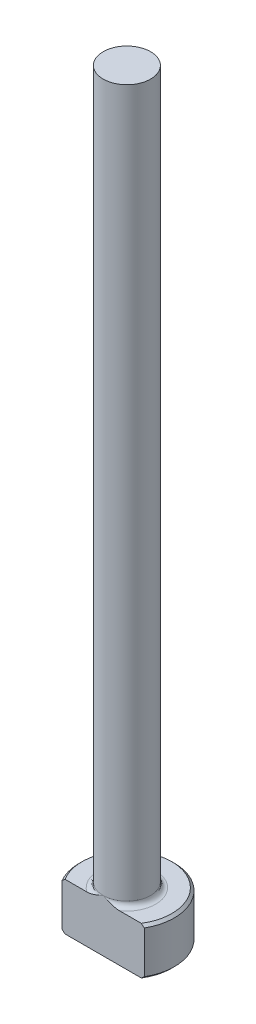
ISO-10303-21;
HEADER;
FILE_DESCRIPTION(('STEP AP214'),'2;1');
FILE_NAME('part.step','',(''),(''),'','','');
FILE_SCHEMA(('AUTOMOTIVE_DESIGN { 1 0 10303 214 1 1 1 1 }'));
ENDSEC;
DATA;
#1=APPLICATION_CONTEXT('core data for automotive mechanical design processes');
#2=APPLICATION_PROTOCOL_DEFINITION('international standard','automotive_design',2000,#1);
#3=PRODUCT_CONTEXT('',#1,'mechanical');
#4=PRODUCT('Part','Part','',(#3));
#5=PRODUCT_RELATED_PRODUCT_CATEGORY('part','',(#4));
#6=PRODUCT_DEFINITION_FORMATION('','',#4);
#7=PRODUCT_DEFINITION_CONTEXT('part definition',#1,'design');
#8=PRODUCT_DEFINITION('design','',#6,#7);
#9=PRODUCT_DEFINITION_SHAPE('','',#8);
#10=(LENGTH_UNIT() NAMED_UNIT(*) SI_UNIT(.MILLI.,.METRE.));
#11=(NAMED_UNIT(*) PLANE_ANGLE_UNIT() SI_UNIT($,.RADIAN.));
#12=(NAMED_UNIT(*) SI_UNIT($,.STERADIAN.) SOLID_ANGLE_UNIT());
#13=UNCERTAINTY_MEASURE_WITH_UNIT(LENGTH_MEASURE(1.E-05),#10,'distance_accuracy_value','');
#14=(GEOMETRIC_REPRESENTATION_CONTEXT(3) GLOBAL_UNCERTAINTY_ASSIGNED_CONTEXT((#13)) GLOBAL_UNIT_ASSIGNED_CONTEXT((#10,
#11,#12)) REPRESENTATION_CONTEXT('',''));
#15=CARTESIAN_POINT('',(0.,0.,0.));
#16=DIRECTION('',(0.,0.,1.));
#17=DIRECTION('',(1.,0.,0.));
#18=AXIS2_PLACEMENT_3D('',#15,#16,#17);
#19=CARTESIAN_POINT('',(0.,0.,0.));
#20=DIRECTION('',(0.,-1.,0.));
#21=DIRECTION('',(0.,0.,-1.));
#22=AXIS2_PLACEMENT_3D('',#19,#20,#21);
#23=PLANE('',#22);
#24=DIRECTION('',(1.,0.,0.));
#25=VECTOR('',#24,1.);
#26=CARTESIAN_POINT('',(-4.12444598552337,0.,2.38124999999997));
#27=LINE('',#26,#25);
#28=CARTESIAN_POINT('',(-3.82834437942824,0.,2.38124999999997));
#29=VERTEX_POINT('',#28);
#30=CARTESIAN_POINT('',(3.82834437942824,0.,2.38124999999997));
#31=VERTEX_POINT('',#30);
#32=EDGE_CURVE('E92',#29,#31,#27,.T.);
#33=ORIENTED_EDGE('',*,*,#32,.F.);
#34=CARTESIAN_POINT('',(0.,0.,0.));
#35=DIRECTION('',(0.,-1.,0.));
#36=DIRECTION('',(0.,0.,-1.));
#37=AXIS2_PLACEMENT_3D('',#34,#35,#36);
#38=CIRCLE('',#37,4.50849999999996);
#39=EDGE_CURVE('E105',#29,#31,#38,.T.);
#40=ORIENTED_EDGE('',*,*,#39,.T.);
#41=EDGE_LOOP('',(#33,#40));
#42=FACE_BOUND('',#41,.T.);
#43=ADVANCED_FACE('F37',(#42),#23,.T.);
#44=CARTESIAN_POINT('',(0.,259.958771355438,0.));
#45=DIRECTION('',(0.,1.,0.));
#46=DIRECTION('',(0.,0.,1.));
#47=AXIS2_PLACEMENT_3D('',#44,#45,#46);
#48=CYLINDRICAL_SURFACE('',#47,4.76249999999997);
#49=DIRECTION('',(0.,-1.,0.));
#50=VECTOR('',#49,1.);
#51=CARTESIAN_POINT('',(-4.12444598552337,76.2,2.38124999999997));
#52=LINE('',#51,#50);
#53=CARTESIAN_POINT('',(-4.12444598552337,4.49580000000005,2.38124999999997));
#54=VERTEX_POINT('',#53);
#55=CARTESIAN_POINT('',(-4.12444598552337,0.254000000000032,2.38124999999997));
#56=VERTEX_POINT('',#55);
#57=EDGE_CURVE('E95',#54,#56,#52,.T.);
#58=ORIENTED_EDGE('',*,*,#57,.F.);
#59=CARTESIAN_POINT('',(0.,4.49580000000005,0.));
#60=DIRECTION('',(0.,1.,0.));
#61=DIRECTION('',(0.,0.,1.));
#62=AXIS2_PLACEMENT_3D('',#59,#60,#61);
#63=CIRCLE('',#62,4.76249999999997);
#64=CARTESIAN_POINT('',(4.12444598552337,4.49580000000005,2.38124999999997));
#65=VERTEX_POINT('',#64);
#66=EDGE_CURVE('E109',#54,#65,#63,.F.);
#67=ORIENTED_EDGE('',*,*,#66,.T.);
#68=DIRECTION('',(0.,-1.,0.));
#69=VECTOR('',#68,1.);
#70=CARTESIAN_POINT('',(4.12444598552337,76.2,2.38124999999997));
#71=LINE('',#70,#69);
#72=CARTESIAN_POINT('',(4.12444598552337,0.254000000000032,2.38124999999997));
#73=VERTEX_POINT('',#72);
#74=EDGE_CURVE('E187',#65,#73,#71,.T.);
#75=ORIENTED_EDGE('',*,*,#74,.T.);
#76=CARTESIAN_POINT('',(0.,0.254000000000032,0.));
#77=DIRECTION('',(0.,-1.,0.));
#78=DIRECTION('',(0.,0.,-1.));
#79=AXIS2_PLACEMENT_3D('',#76,#77,#78);
#80=CIRCLE('',#79,4.76249999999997);
#81=EDGE_CURVE('E115',#73,#56,#80,.F.);
#82=ORIENTED_EDGE('',*,*,#81,.T.);
#83=EDGE_LOOP('',(#58,#67,#75,#82));
#84=FACE_BOUND('',#83,.T.);
#85=ADVANCED_FACE('F160',(#84),#48,.T.);
#86=CARTESIAN_POINT('',(-4.76249999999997,4.7498,0.));
#87=DIRECTION('',(0.,1.,0.));
#88=DIRECTION('',(0.,0.,1.));
#89=AXIS2_PLACEMENT_3D('',#86,#87,#88);
#90=PLANE('',#89);
#91=DIRECTION('',(-1.,0.,0.));
#92=VECTOR('',#91,1.);
#93=CARTESIAN_POINT('',(-4.76249999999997,4.7498,2.38124999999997));
#94=LINE('',#93,#92);
#95=CARTESIAN_POINT('',(3.82834437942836,4.7498,2.38124999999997));
#96=VERTEX_POINT('',#95);
#97=CARTESIAN_POINT('',(1.63628053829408,4.7498,2.38124999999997));
#98=VERTEX_POINT('',#97);
#99=EDGE_CURVE('E58',#96,#98,#94,.T.);
#100=ORIENTED_EDGE('',*,*,#99,.F.);
#101=CARTESIAN_POINT('',(0.,4.7498,0.));
#102=DIRECTION('',(0.,1.,0.));
#103=DIRECTION('',(0.,0.,1.));
#104=AXIS2_PLACEMENT_3D('',#101,#102,#103);
#105=CIRCLE('',#104,4.50850000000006);
#106=CARTESIAN_POINT('',(-3.82834437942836,4.7498,2.38124999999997));
#107=VERTEX_POINT('',#106);
#108=EDGE_CURVE('E182',#96,#107,#105,.T.);
#109=ORIENTED_EDGE('',*,*,#108,.T.);
#110=CARTESIAN_POINT('',(-1.63628053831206,4.74979999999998,2.38124999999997));
#111=VERTEX_POINT('',#110);
#112=EDGE_CURVE('E140',#111,#107,#94,.T.);
#113=ORIENTED_EDGE('',*,*,#112,.F.);
#114=CARTESIAN_POINT('',(0.,4.7498,0.));
#115=DIRECTION('',(0.,1.,0.));
#116=DIRECTION('',(0.,0.,1.));
#117=AXIS2_PLACEMENT_3D('',#114,#115,#116);
#118=CIRCLE('',#117,2.88924999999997);
#119=EDGE_CURVE('E112',#111,#98,#118,.F.);
#120=ORIENTED_EDGE('',*,*,#119,.T.);
#121=EDGE_LOOP('',(#100,#109,#113,#120));
#122=FACE_BOUND('',#121,.T.);
#123=ADVANCED_FACE('F164',(#122),#90,.T.);
#124=CARTESIAN_POINT('',(0.,259.958771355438,0.));
#125=DIRECTION('',(0.,1.,0.));
#126=DIRECTION('',(0.,0.,1.));
#127=AXIS2_PLACEMENT_3D('',#124,#125,#126);
#128=CYLINDRICAL_SURFACE('',#127,2.38124999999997);
#129=CARTESIAN_POINT('',(0.,5.25779999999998,0.));
#130=DIRECTION('',(0.,1.,0.));
#131=DIRECTION('',(0.,0.,1.));
#132=AXIS2_PLACEMENT_3D('',#129,#130,#131);
#133=CIRCLE('',#132,2.38124999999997);
#134=CARTESIAN_POINT('',(0.,5.25779999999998,2.38124999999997));
#135=VERTEX_POINT('',#134);
#136=EDGE_CURVE('E108',#135,#135,#133,.T.);
#137=ORIENTED_EDGE('',*,*,#136,.T.);
#138=EDGE_LOOP('',(#137));
#139=FACE_BOUND('',#138,.T.);
#140=CARTESIAN_POINT('',(0.,76.2,0.));
#141=DIRECTION('',(0.,1.,0.));
#142=DIRECTION('',(0.,0.,1.));
#143=AXIS2_PLACEMENT_3D('',#140,#141,#142);
#144=CIRCLE('',#143,2.38124999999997);
#145=CARTESIAN_POINT('',(0.,76.2,2.38124999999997));
#146=VERTEX_POINT('',#145);
#147=EDGE_CURVE('E100',#146,#146,#144,.T.);
#148=ORIENTED_EDGE('',*,*,#147,.F.);
#149=EDGE_LOOP('',(#148));
#150=FACE_BOUND('',#149,.T.);
#151=ADVANCED_FACE('F169',(#139,#150),#128,.T.);
#152=CARTESIAN_POINT('',(-2.38124999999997,76.2,0.));
#153=DIRECTION('',(0.,1.,0.));
#154=DIRECTION('',(0.,0.,1.));
#155=AXIS2_PLACEMENT_3D('',#152,#153,#154);
#156=PLANE('',#155);
#157=ORIENTED_EDGE('',*,*,#147,.T.);
#158=EDGE_LOOP('',(#157));
#159=FACE_BOUND('',#158,.T.);
#160=ADVANCED_FACE('F127',(#159),#156,.T.);
#161=CARTESIAN_POINT('',(0.,4.74980000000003,0.));
#162=DIRECTION('',(0.,-1.,0.));
#163=DIRECTION('',(0.,0.,-1.));
#164=AXIS2_PLACEMENT_3D('',#161,#162,#163);
#165=CONICAL_SURFACE('',#164,4.50850000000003,0.785398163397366);
#166=CARTESIAN_POINT('',(4.12514598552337,4.49519376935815,2.38124999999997));
#167=CARTESIAN_POINT('',(4.00297518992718,4.60095936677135,2.38124999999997));
#168=CARTESIAN_POINT('',(3.88025631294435,4.70610504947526,2.38124999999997));
#169=CARTESIAN_POINT('',(3.63329815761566,4.91471466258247,2.38124999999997));
#170=CARTESIAN_POINT('',(3.509058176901,5.01817776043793,2.38124999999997));
#171=CARTESIAN_POINT('',(3.25581608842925,5.22527725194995,2.38124999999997));
#172=CARTESIAN_POINT('',(3.126770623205,5.32886083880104,2.38124999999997));
#173=CARTESIAN_POINT('',(2.86622698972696,5.53284356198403,2.38124999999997));
#174=CARTESIAN_POINT('',(2.73472944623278,5.63324349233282,2.38124999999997));
#175=CARTESIAN_POINT('',(2.46828886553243,5.82978962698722,2.38124999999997));
#176=CARTESIAN_POINT('',(2.33334128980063,5.92592971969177,2.38124999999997));
#177=CARTESIAN_POINT('',(2.05897760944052,6.11194575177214,2.38124999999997));
#178=CARTESIAN_POINT('',(1.91955795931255,6.20181653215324,2.38124999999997));
#179=CARTESIAN_POINT('',(1.63609152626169,6.37137961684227,2.38124999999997));
#180=CARTESIAN_POINT('',(1.49209041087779,6.45114724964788,2.38124999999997));
#181=CARTESIAN_POINT('',(1.19698803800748,6.59621615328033,2.38124999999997));
#182=CARTESIAN_POINT('',(1.0459006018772,6.66154427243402,2.38124999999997));
#183=CARTESIAN_POINT('',(0.811614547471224,6.74362759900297,2.38124999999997));
#184=CARTESIAN_POINT('',(0.731281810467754,6.76852601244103,2.38124999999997));
#185=CARTESIAN_POINT('',(0.568750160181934,6.8113251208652,2.38124999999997));
#186=CARTESIAN_POINT('',(0.486551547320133,6.82922693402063,2.38124999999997));
#187=CARTESIAN_POINT('',(0.321272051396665,6.85684671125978,2.38124999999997));
#188=CARTESIAN_POINT('',(0.238199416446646,6.86661311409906,2.38124999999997));
#189=CARTESIAN_POINT('',(0.0714834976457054,6.87742889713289,2.38124999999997));
#190=CARTESIAN_POINT('',(-0.012159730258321,6.87847911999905,2.38124999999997));
#191=CARTESIAN_POINT('',(-0.179163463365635,6.87177943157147,2.38124999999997));
#192=CARTESIAN_POINT('',(-0.2625236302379,6.8640212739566,2.38124999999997));
#193=CARTESIAN_POINT('',(-0.428053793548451,6.84027123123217,2.38124999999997));
#194=CARTESIAN_POINT('',(-0.510223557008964,6.82427775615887,2.38124999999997));
#195=CARTESIAN_POINT('',(-0.673363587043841,6.78495183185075,2.38124999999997));
#196=CARTESIAN_POINT('',(-0.754321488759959,6.76156896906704,2.38124999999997));
#197=CARTESIAN_POINT('',(-0.914191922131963,6.70871125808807,2.38124999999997));
#198=CARTESIAN_POINT('',(-0.993104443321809,6.67923637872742,2.38124999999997));
#199=CARTESIAN_POINT('',(-1.16723389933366,6.60781445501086,2.38124999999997));
#200=CARTESIAN_POINT('',(-1.26191225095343,6.56456501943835,2.38124999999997));
#201=CARTESIAN_POINT('',(-1.44844363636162,6.47230549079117,2.38124999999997));
#202=CARTESIAN_POINT('',(-1.54029498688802,6.42329204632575,2.38124999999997));
#203=CARTESIAN_POINT('',(-1.72169646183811,6.32078732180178,2.38124999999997));
#204=CARTESIAN_POINT('',(-1.81124138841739,6.26728691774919,2.38124999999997));
#205=CARTESIAN_POINT('',(-1.98819821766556,6.15692869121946,2.38124999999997));
#206=CARTESIAN_POINT('',(-2.07561054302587,6.10007154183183,2.38124999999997));
#207=CARTESIAN_POINT('',(-2.24912105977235,5.98343359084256,2.38124999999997));
#208=CARTESIAN_POINT('',(-2.33520994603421,5.92363901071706,2.38124999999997));
#209=CARTESIAN_POINT('',(-2.50589894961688,5.8019565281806,2.38124999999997));
#210=CARTESIAN_POINT('',(-2.59049895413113,5.74006846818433,2.38124999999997));
#211=CARTESIAN_POINT('',(-2.8422366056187,5.55206990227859,2.38124999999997));
#212=CARTESIAN_POINT('',(-3.00752130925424,5.42348112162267,2.38124999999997));
#213=CARTESIAN_POINT('',(-3.33377354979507,5.16258132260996,2.38124999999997));
#214=CARTESIAN_POINT('',(-3.49475818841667,5.03029147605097,2.38124999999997));
#215=CARTESIAN_POINT('',(-3.73348531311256,4.83027359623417,2.38124999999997));
#216=CARTESIAN_POINT('',(-3.81219356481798,4.76369334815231,2.38124999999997));
#217=CARTESIAN_POINT('',(-3.96906071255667,4.62989594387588,2.38124999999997));
#218=CARTESIAN_POINT('',(-4.04721963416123,4.56267881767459,2.38124999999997));
#219=CARTESIAN_POINT('',(-4.12514598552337,4.49519376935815,2.38124999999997));
#220=B_SPLINE_CURVE_WITH_KNOTS('',3,(#166,#167,#168,#169,#170,#171,#172,#173,#174,#175,#176,
#177,#178,#179,#180,#181,#182,#183,#184,#185,#186,#187,#188,#189,#190,#191,#192,#193,#194,#195,
#196,#197,#198,#199,#200,#201,#202,#203,#204,#205,#206,#207,#208,#209,#210,#211,#212,#213,#214,
#215,#216,#217,#218,#219),.UNSPECIFIED.,.F.,.F.,(4,2,2,2,2,2,2,2,2,2,2,2,2,2,2,2,2,2,2,2,2,2,2,
2,2,2,4),(0.,0.484787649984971,0.969808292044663,1.46620017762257,1.96246727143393,
2.45942471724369,2.95678639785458,3.45018895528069,3.94266623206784,4.19472143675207,
4.44673634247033,4.69723978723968,4.94771901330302,5.1984329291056,5.44919526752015,
5.70170675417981,5.95421953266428,6.26622041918,6.57840361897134,6.89123777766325,
7.20400941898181,7.51842263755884,7.83285957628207,8.46097181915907,9.08602581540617,
9.39529830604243,9.7045563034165),.UNSPECIFIED.);
#221=EDGE_CURVE('E63',#65,#96,#220,.T.);
#222=ORIENTED_EDGE('',*,*,#221,.F.);
#223=ORIENTED_EDGE('',*,*,#66,.F.);
#224=EDGE_CURVE('E133',#107,#54,#220,.T.);
#225=ORIENTED_EDGE('',*,*,#224,.F.);
#226=ORIENTED_EDGE('',*,*,#108,.F.);
#227=EDGE_LOOP('',(#222,#223,#225,#226));
#228=FACE_BOUND('',#227,.T.);
#229=ADVANCED_FACE('F147',(#228),#165,.T.);
#230=CARTESIAN_POINT('',(0.,0.254000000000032,0.));
#231=DIRECTION('',(0.,1.,0.));
#232=DIRECTION('',(0.,0.,1.));
#233=AXIS2_PLACEMENT_3D('',#230,#231,#232);
#234=CONICAL_SURFACE('',#233,4.76249999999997,0.785398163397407);
#235=CARTESIAN_POINT('',(-4.12514598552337,0.254606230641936,2.38124999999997));
#236=CARTESIAN_POINT('',(-4.00297518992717,0.148840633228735,2.38124999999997));
#237=CARTESIAN_POINT('',(-3.88025631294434,0.0436949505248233,2.38124999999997));
#238=CARTESIAN_POINT('',(-3.63329815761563,-0.164914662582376,2.38124999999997));
#239=CARTESIAN_POINT('',(-3.50905817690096,-0.268377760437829,2.38124999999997));
#240=CARTESIAN_POINT('',(-3.2558160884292,-0.475477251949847,2.38124999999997));
#241=CARTESIAN_POINT('',(-3.12677062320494,-0.579060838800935,2.38124999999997));
#242=CARTESIAN_POINT('',(-2.86622698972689,-0.783043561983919,2.38124999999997));
#243=CARTESIAN_POINT('',(-2.7347294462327,-0.88344349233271,2.38124999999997));
#244=CARTESIAN_POINT('',(-2.46828886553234,-1.0799896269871,2.38124999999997));
#245=CARTESIAN_POINT('',(-2.33334128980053,-1.17612971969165,2.38124999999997));
#246=CARTESIAN_POINT('',(-2.0589776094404,-1.362145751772,2.38124999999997));
#247=CARTESIAN_POINT('',(-1.91955795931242,-1.4520165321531,2.38124999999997));
#248=CARTESIAN_POINT('',(-1.63609152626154,-1.62157961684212,2.38124999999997));
#249=CARTESIAN_POINT('',(-1.49209041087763,-1.70134724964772,2.38124999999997));
#250=CARTESIAN_POINT('',(-1.1969880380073,-1.84641615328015,2.38124999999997));
#251=CARTESIAN_POINT('',(-1.04590060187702,-1.91174427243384,2.38124999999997));
#252=CARTESIAN_POINT('',(-0.811614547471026,-1.99382759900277,2.38124999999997));
#253=CARTESIAN_POINT('',(-0.731281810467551,-2.01872601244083,2.38124999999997));
#254=CARTESIAN_POINT('',(-0.568750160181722,-2.06152512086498,2.38124999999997));
#255=CARTESIAN_POINT('',(-0.486551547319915,-2.0794269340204,2.38124999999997));
#256=CARTESIAN_POINT('',(-0.321272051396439,-2.10704671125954,2.38124999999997));
#257=CARTESIAN_POINT('',(-0.238199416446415,-2.11681311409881,2.38124999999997));
#258=CARTESIAN_POINT('',(-0.0714834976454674,-2.12762889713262,2.38124999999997));
#259=CARTESIAN_POINT('',(0.012159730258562,-2.12867911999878,2.38124999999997));
#260=CARTESIAN_POINT('',(0.17916346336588,-2.12197943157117,2.38124999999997));
#261=CARTESIAN_POINT('',(0.262523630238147,-2.1142212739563,2.38124999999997));
#262=CARTESIAN_POINT('',(0.4280537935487,-2.09047123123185,2.38124999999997));
#263=CARTESIAN_POINT('',(0.510223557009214,-2.07447775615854,2.38124999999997));
#264=CARTESIAN_POINT('',(0.673363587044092,-2.03515183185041,2.38124999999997));
#265=CARTESIAN_POINT('',(0.754321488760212,-2.01176896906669,2.38124999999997));
#266=CARTESIAN_POINT('',(0.914191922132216,-1.95891125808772,2.38124999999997));
#267=CARTESIAN_POINT('',(0.993104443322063,-1.92943637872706,2.38124999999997));
#268=CARTESIAN_POINT('',(1.16723389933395,-1.85801445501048,2.38124999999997));
#269=CARTESIAN_POINT('',(1.26191225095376,-1.81476501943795,2.38124999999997));
#270=CARTESIAN_POINT('',(1.44844363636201,-1.72250549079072,2.38124999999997));
#271=CARTESIAN_POINT('',(1.54029498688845,-1.67349204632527,2.38124999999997));
#272=CARTESIAN_POINT('',(1.72169646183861,-1.57098732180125,2.38124999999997));
#273=CARTESIAN_POINT('',(1.81124138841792,-1.51748691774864,2.38124999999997));
#274=CARTESIAN_POINT('',(1.98819821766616,-1.40712869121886,2.38124999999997));
#275=CARTESIAN_POINT('',(2.07561054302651,-1.3502715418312,2.38124999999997));
#276=CARTESIAN_POINT('',(2.24912105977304,-1.23363359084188,2.38124999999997));
#277=CARTESIAN_POINT('',(2.33520994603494,-1.17383901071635,2.38124999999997));
#278=CARTESIAN_POINT('',(2.50589894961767,-1.05215652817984,2.38124999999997));
#279=CARTESIAN_POINT('',(2.59049895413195,-0.990268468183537,2.38124999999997));
#280=CARTESIAN_POINT('',(2.84223660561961,-0.80226990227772,2.38124999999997));
#281=CARTESIAN_POINT('',(3.00752130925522,-0.673681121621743,2.38124999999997));
#282=CARTESIAN_POINT('',(3.33377354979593,-0.412781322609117,2.38124999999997));
#283=CARTESIAN_POINT('',(3.49475818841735,-0.280491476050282,2.38124999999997));
#284=CARTESIAN_POINT('',(3.73348531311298,-0.0804735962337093,2.38124999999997));
#285=CARTESIAN_POINT('',(3.81219356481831,-0.0138933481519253,2.38124999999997));
#286=CARTESIAN_POINT('',(3.96906071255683,0.119904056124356,2.38124999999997));
#287=CARTESIAN_POINT('',(4.04721963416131,0.187121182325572,2.38124999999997));
#288=CARTESIAN_POINT('',(4.12514598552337,0.254606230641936,2.38124999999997));
#289=B_SPLINE_CURVE_WITH_KNOTS('',3,(#235,#236,#237,#238,#239,#240,#241,#242,#243,#244,#245,
#246,#247,#248,#249,#250,#251,#252,#253,#254,#255,#256,#257,#258,#259,#260,#261,#262,#263,#264,
#265,#266,#267,#268,#269,#270,#271,#272,#273,#274,#275,#276,#277,#278,#279,#280,#281,#282,#283,
#284,#285,#286,#287,#288),.UNSPECIFIED.,.F.,.F.,(4,2,2,2,2,2,2,2,2,2,2,2,2,2,2,2,2,2,2,2,2,2,2,
2,2,2,4),(0.,0.484787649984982,0.969808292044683,1.46620017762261,1.96246727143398,
2.45942471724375,2.95678639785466,3.45018895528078,3.94266623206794,4.19472143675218,
4.44673634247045,4.69723978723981,4.94771901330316,5.19843292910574,5.4491952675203,
5.70170675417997,5.95421953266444,6.26622041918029,6.57840361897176,6.89123777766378,
7.20400941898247,7.51842263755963,7.83285957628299,8.46097181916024,9.08602581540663,
9.39529830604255,9.70455630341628),.UNSPECIFIED.);
#290=EDGE_CURVE('E89',#56,#29,#289,.T.);
#291=ORIENTED_EDGE('',*,*,#290,.F.);
#292=ORIENTED_EDGE('',*,*,#81,.F.);
#293=EDGE_CURVE('E101',#31,#73,#289,.T.);
#294=ORIENTED_EDGE('',*,*,#293,.F.);
#295=ORIENTED_EDGE('',*,*,#39,.F.);
#296=EDGE_LOOP('',(#291,#292,#294,#295));
#297=FACE_BOUND('',#296,.T.);
#298=ADVANCED_FACE('F107',(#297),#234,.T.);
#299=CARTESIAN_POINT('',(0.,5.25779999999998,0.));
#300=DIRECTION('',(0.,1.,0.));
#301=DIRECTION('',(0.,0.,1.));
#302=AXIS2_PLACEMENT_3D('',#299,#300,#301);
#303=TOROIDAL_SURFACE('',#302,2.88924999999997,0.508);
#304=ORIENTED_EDGE('',*,*,#119,.F.);
#305=CARTESIAN_POINT('',(0.,5.25779999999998,2.38124999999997));
#306=CARTESIAN_POINT('',(0.,5.25780082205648,2.38124999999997));
#307=CARTESIAN_POINT('',(-1.44246315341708E-07,5.25780164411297,2.38124999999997));
#308=CARTESIAN_POINT('',(-6.16936500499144E-07,5.25780323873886,2.38124999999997));
#309=CARTESIAN_POINT('',(-9.48586306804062E-07,5.25780401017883,2.38124999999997));
#310=CARTESIAN_POINT('',(-1.75082077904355E-06,5.25780554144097,2.38124999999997));
#311=CARTESIAN_POINT('',(-2.22915456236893E-06,5.25780629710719,2.38124999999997));
#312=CARTESIAN_POINT('',(-3.27181458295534E-06,5.25780773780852,2.38124999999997));
#313=CARTESIAN_POINT('',(-3.835676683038E-06,5.25780842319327,2.38124999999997));
#314=CARTESIAN_POINT('',(-5.8221973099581E-06,5.25781066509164,2.38124999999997));
#315=CARTESIAN_POINT('',(-7.35849850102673E-06,5.25781212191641,2.38124999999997));
#316=CARTESIAN_POINT('',(-1.05702998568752E-05,5.25781476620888,2.38124999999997));
#317=CARTESIAN_POINT('',(-1.22411084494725E-05,5.2578159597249,2.38124999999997));
#318=CARTESIAN_POINT('',(-1.86111247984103E-05,5.25782030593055,2.38124999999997));
#319=CARTESIAN_POINT('',(-2.34784761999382E-05,5.25782322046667,2.38124999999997));
#320=CARTESIAN_POINT('',(-3.31956636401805E-05,5.25782811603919,2.38124999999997));
#321=CARTESIAN_POINT('',(-3.80196285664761E-05,5.25783015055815,2.38124999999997));
#322=CARTESIAN_POINT('',(-5.813261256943E-05,5.25783854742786,2.38124999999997));
#323=CARTESIAN_POINT('',(-7.34799232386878E-05,5.25784474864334,2.38124999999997));
#324=CARTESIAN_POINT('',(-0.000102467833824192,5.25785494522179,2.38124999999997));
#325=CARTESIAN_POINT('',(-0.000116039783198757,5.25785912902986,2.38124999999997));
#326=CARTESIAN_POINT('',(-0.000212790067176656,5.25789158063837,2.38124999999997));
#327=CARTESIAN_POINT('',(-0.000291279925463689,5.2579320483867,2.38124999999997));
#328=CARTESIAN_POINT('',(-0.000593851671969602,5.25808218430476,2.38124999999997));
#329=CARTESIAN_POINT('',(-0.000821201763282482,5.25818279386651,2.38124999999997));
#330=CARTESIAN_POINT('',(-0.00169456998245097,5.25857522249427,2.38124999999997));
#331=CARTESIAN_POINT('',(-0.00233722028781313,5.25887652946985,2.38124999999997));
#332=CARTESIAN_POINT('',(-0.00493753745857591,5.26008964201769,2.38124999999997));
#333=CARTESIAN_POINT('',(-0.00689891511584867,5.26099082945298,2.38124999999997));
#334=CARTESIAN_POINT('',(-0.0508383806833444,5.281187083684,2.38124999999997));
#335=CARTESIAN_POINT('',(-0.0927708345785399,5.30061501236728,2.38124999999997));
#336=CARTESIAN_POINT('',(-0.17527482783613,5.33851044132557,2.38124999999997));
#337=CARTESIAN_POINT('',(-0.215842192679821,5.35698764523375,2.38124999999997));
#338=CARTESIAN_POINT('',(-0.301665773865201,5.39563561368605,2.38124999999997));
#339=CARTESIAN_POINT('',(-0.346940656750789,5.41576561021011,2.38124999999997));
#340=CARTESIAN_POINT('',(-0.438241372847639,5.45551278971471,2.38124999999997));
#341=CARTESIAN_POINT('',(-0.4842702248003,5.47512306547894,2.38124999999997));
#342=CARTESIAN_POINT('',(-0.565317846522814,5.50863652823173,2.38124999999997));
#343=CARTESIAN_POINT('',(-0.600248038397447,5.52275299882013,2.38124999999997));
#344=CARTESIAN_POINT('',(-0.670295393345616,5.55026700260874,2.38124999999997));
#345=CARTESIAN_POINT('',(-0.705411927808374,5.56366614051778,2.38124999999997));
#346=CARTESIAN_POINT('',(-0.809765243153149,5.60210810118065,2.38124999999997));
#347=CARTESIAN_POINT('',(-0.87943714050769,5.6259984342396,2.38124999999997));
#348=CARTESIAN_POINT('',(-0.996836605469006,5.66231043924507,2.38124999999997));
#349=CARTESIAN_POINT('',(-1.04419582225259,5.67591104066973,2.38124999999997));
#350=CARTESIAN_POINT('',(-1.13975994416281,5.70085221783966,2.38124999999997));
#351=CARTESIAN_POINT('',(-1.18796799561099,5.71218047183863,2.38124999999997));
#352=CARTESIAN_POINT('',(-1.33841293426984,5.74296860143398,2.38124999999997));
#353=CARTESIAN_POINT('',(-1.44177435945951,5.75767400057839,2.38124999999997));
#354=CARTESIAN_POINT('',(-1.60936912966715,5.76674980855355,2.38124999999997));
#355=CARTESIAN_POINT('',(-1.67328580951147,5.76678281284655,2.38124999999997));
#356=CARTESIAN_POINT('',(-1.79988036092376,5.75818170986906,2.38124999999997));
#357=CARTESIAN_POINT('',(-1.86256375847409,5.7496552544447,2.38124999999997));
#358=CARTESIAN_POINT('',(-1.9663105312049,5.72616398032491,2.38124999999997));
#359=CARTESIAN_POINT('',(-2.00801024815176,5.71404279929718,2.38124999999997));
#360=CARTESIAN_POINT('',(-2.08929854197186,5.6837572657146,2.38124999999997));
#361=CARTESIAN_POINT('',(-2.12888534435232,5.66558792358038,2.38124999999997));
#362=CARTESIAN_POINT('',(-2.19343451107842,5.62845715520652,2.38124999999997));
#363=CARTESIAN_POINT('',(-2.21936120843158,5.61118061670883,2.38124999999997));
#364=CARTESIAN_POINT('',(-2.26821976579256,5.57281353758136,2.38124999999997));
#365=CARTESIAN_POINT('',(-2.29115716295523,5.55173022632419,2.38124999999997));
#366=CARTESIAN_POINT('',(-2.3283351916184,5.51065246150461,2.38124999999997));
#367=CARTESIAN_POINT('',(-2.34338589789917,5.49139467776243,2.38124999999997));
#368=CARTESIAN_POINT('',(-2.37015797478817,5.45066634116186,2.38124999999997));
#369=CARTESIAN_POINT('',(-2.38188059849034,5.42919662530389,2.38124999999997));
#370=CARTESIAN_POINT('',(-2.40133155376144,5.38427591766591,2.38124999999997));
#371=CARTESIAN_POINT('',(-2.40902526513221,5.3608097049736,2.38124999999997));
#372=CARTESIAN_POINT('',(-2.4196333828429,5.31282025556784,2.38124999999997));
#373=CARTESIAN_POINT('',(-2.42255209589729,5.2882979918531,2.38124999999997));
#374=CARTESIAN_POINT('',(-2.42330579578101,5.24257134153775,2.38124999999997));
#375=CARTESIAN_POINT('',(-2.42178572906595,5.22137526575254,2.38124999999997));
#376=CARTESIAN_POINT('',(-2.41512107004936,5.17956667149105,2.38124999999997));
#377=CARTESIAN_POINT('',(-2.40997679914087,5.15895410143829,2.38124999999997));
#378=CARTESIAN_POINT('',(-2.39653123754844,5.11927433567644,2.38124999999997));
#379=CARTESIAN_POINT('',(-2.38829719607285,5.10018404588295,2.38124999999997));
#380=CARTESIAN_POINT('',(-2.36909923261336,5.06344104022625,2.38124999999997));
#381=CARTESIAN_POINT('',(-2.35813436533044,5.04578882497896,2.38124999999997));
#382=CARTESIAN_POINT('',(-2.3290070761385,5.00527867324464,2.38124999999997));
#383=CARTESIAN_POINT('',(-2.30973049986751,4.98322039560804,2.38124999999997));
#384=CARTESIAN_POINT('',(-2.26785259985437,4.94251014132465,2.38124999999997));
#385=CARTESIAN_POINT('',(-2.24524341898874,4.92386645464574,2.38124999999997));
#386=CARTESIAN_POINT('',(-2.18797490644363,4.88297636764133,2.38124999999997));
#387=CARTESIAN_POINT('',(-2.15215873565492,4.86235631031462,2.38124999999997));
#388=CARTESIAN_POINT('',(-2.07784819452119,4.82703601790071,2.38124999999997));
#389=CARTESIAN_POINT('',(-2.03935503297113,4.812333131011,2.38124999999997));
#390=CARTESIAN_POINT('',(-1.9391704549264,4.78128020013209,2.38124999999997));
#391=CARTESIAN_POINT('',(-1.87638619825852,4.76848853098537,2.38124999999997));
#392=CARTESIAN_POINT('',(-1.74894813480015,4.75239141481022,2.38124999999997));
#393=CARTESIAN_POINT('',(-1.68428057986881,4.74921386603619,2.38124999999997));
#394=CARTESIAN_POINT('',(-1.56080715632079,4.75049930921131,2.38124999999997));
#395=CARTESIAN_POINT('',(-1.50198901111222,4.75431101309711,2.38124999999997));
#396=CARTESIAN_POINT('',(-1.38480921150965,4.76709949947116,2.38124999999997));
#397=CARTESIAN_POINT('',(-1.32644892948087,4.77608822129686,2.38124999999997));
#398=CARTESIAN_POINT('',(-1.2135035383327,4.79766265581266,2.38124999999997));
#399=CARTESIAN_POINT('',(-1.15887777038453,4.81004137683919,2.38124999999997));
#400=CARTESIAN_POINT('',(-1.05073291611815,4.83776073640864,2.38124999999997));
#401=CARTESIAN_POINT('',(-0.997209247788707,4.85308377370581,2.38124999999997));
#402=CARTESIAN_POINT('',(-0.874272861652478,4.89132980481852,2.38124999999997));
#403=CARTESIAN_POINT('',(-0.805134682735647,4.91512993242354,2.38124999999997));
#404=CARTESIAN_POINT('',(-0.701560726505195,4.95339027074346,2.38124999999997));
#405=CARTESIAN_POINT('',(-0.666697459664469,4.96672252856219,2.38124999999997));
#406=CARTESIAN_POINT('',(-0.597152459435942,4.99408908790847,2.38124999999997));
#407=CARTESIAN_POINT('',(-0.562471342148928,5.00812495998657,2.38124999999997));
#408=CARTESIAN_POINT('',(-0.48190509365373,5.04147709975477,2.38124999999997));
#409=CARTESIAN_POINT('',(-0.436107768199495,5.06100454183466,2.38124999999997));
#410=CARTESIAN_POINT('',(-0.345263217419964,5.10057637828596,2.38124999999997));
#411=CARTESIAN_POINT('',(-0.300213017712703,5.12061397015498,2.38124999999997));
#412=CARTESIAN_POINT('',(-0.214815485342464,5.15907936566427,2.38124999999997));
#413=CARTESIAN_POINT('',(-0.174449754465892,5.17746700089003,2.38124999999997));
#414=CARTESIAN_POINT('',(-0.0923551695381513,5.21517676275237,2.38124999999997));
#415=CARTESIAN_POINT('',(-0.0506304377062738,5.23450847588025,2.38124999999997));
#416=CARTESIAN_POINT('',(-0.00689891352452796,5.25460917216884,2.38124999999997));
#417=CARTESIAN_POINT('',(-0.00493753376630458,5.25551035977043,2.38124999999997));
#418=CARTESIAN_POINT('',(-0.00233721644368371,5.25672347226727,2.38124999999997));
#419=CARTESIAN_POINT('',(-0.00169456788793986,5.25702477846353,2.38124999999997));
#420=CARTESIAN_POINT('',(-0.000821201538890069,5.25741720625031,2.38124999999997));
#421=CARTESIAN_POINT('',(-0.000593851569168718,5.25751781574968,2.38124999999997));
#422=CARTESIAN_POINT('',(-0.000291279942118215,5.25766795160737,2.38124999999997));
#423=CARTESIAN_POINT('',(-0.000212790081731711,5.25770841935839,2.38124999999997));
#424=CARTESIAN_POINT('',(-0.00011603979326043,5.25774087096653,2.38124999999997));
#425=CARTESIAN_POINT('',(-0.000102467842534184,5.25774505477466,2.38124999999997));
#426=CARTESIAN_POINT('',(-7.347992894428E-05,5.25775525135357,2.38124999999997));
#427=CARTESIAN_POINT('',(-5.81326166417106E-05,5.25776145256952,2.38124999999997));
#428=CARTESIAN_POINT('',(-3.80196306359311E-05,5.25776984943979,2.38124999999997));
#429=CARTESIAN_POINT('',(-3.31956653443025E-05,5.25777188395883,2.38124999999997));
#430=CARTESIAN_POINT('',(-2.34784771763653E-05,5.25777677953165,2.38124999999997));
#431=CARTESIAN_POINT('',(-1.86111254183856E-05,5.25777969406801,2.38124999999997));
#432=CARTESIAN_POINT('',(-1.2241108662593E-05,5.25778404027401,2.38124999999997));
#433=CARTESIAN_POINT('',(-1.05702999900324E-05,5.25778523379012,2.38124999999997));
#434=CARTESIAN_POINT('',(-7.35849849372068E-06,5.25778787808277,2.38124999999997));
#435=CARTESIAN_POINT('',(-5.82219724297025E-06,5.25778933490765,2.38124999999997));
#436=CARTESIAN_POINT('',(-3.83567656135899E-06,5.25779157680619,2.38124999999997));
#437=CARTESIAN_POINT('',(-3.27181445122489E-06,5.25779226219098,2.38124999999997));
#438=CARTESIAN_POINT('',(-2.22915442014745E-06,5.25779370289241,2.38124999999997));
#439=CARTESIAN_POINT('',(-1.75082063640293E-06,5.25779445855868,2.38124999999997));
#440=CARTESIAN_POINT('',(-9.48586177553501E-07,5.25779598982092,2.38124999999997));
#441=CARTESIAN_POINT('',(-6.16936383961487E-07,5.25779676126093,2.38124999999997));
#442=CARTESIAN_POINT('',(-1.44246242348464E-07,5.25779835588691,2.38124999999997));
#443=CARTESIAN_POINT('',(0.,5.25779917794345,2.38124999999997));
#444=CARTESIAN_POINT('',(0.,5.25779999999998,2.38124999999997));
#445=B_SPLINE_CURVE_WITH_KNOTS('',3,(#305,#306,#307,#308,#309,#310,#311,#312,#313,#314,#315,
#316,#317,#318,#319,#320,#321,#322,#323,#324,#325,#326,#327,#328,#329,#330,#331,#332,#333,#334,
#335,#336,#337,#338,#339,#340,#341,#342,#343,#344,#345,#346,#347,#348,#349,#350,#351,#352,#353,
#354,#355,#356,#357,#358,#359,#360,#361,#362,#363,#364,#365,#366,#367,#368,#369,#370,#371,#372,
#373,#374,#375,#376,#377,#378,#379,#380,#381,#382,#383,#384,#385,#386,#387,#388,#389,#390,#391,
#392,#393,#394,#395,#396,#397,#398,#399,#400,#401,#402,#403,#404,#405,#406,#407,#408,#409,#410,
#411,#412,#413,#414,#415,#416,#417,#418,#419,#420,#421,#422,#423,#424,#425,#426,#427,#428,#429,
#430,#431,#432,#433,#434,#435,#436,#437,#438,#439,#440,#441,#442,#443,#444),.UNSPECIFIED.,.T.,
.F.,(4,2,2,2,2,2,2,2,2,2,2,2,2,2,2,2,2,2,2,2,2,2,2,2,2,2,2,2,2,2,2,2,2,2,2,2,2,2,2,2,2,2,2,2,2,
2,2,2,2,2,2,2,2,2,2,2,2,2,2,2,2,2,2,2,2,2,2,2,2,4),(0.,2.46370364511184E-06,
4.97088840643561E-06,7.64418246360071E-06,1.03034566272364E-05,1.66236496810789E-05,
2.27785420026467E-05,3.9736495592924E-05,5.54272301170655E-05,0.000105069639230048,
0.000147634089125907,0.000411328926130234,0.00115816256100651,0.00328628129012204,
0.00976302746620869,0.148387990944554,0.282122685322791,0.430762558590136,0.58085063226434,
0.693868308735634,0.806621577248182,1.02747193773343,1.17523360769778,1.32377605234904,
1.63564503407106,1.8269819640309,2.01594223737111,2.14586868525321,2.27590258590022,
2.36907162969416,2.46206556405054,2.53511017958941,2.60812725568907,2.68176187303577,
2.75533004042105,2.81876340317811,2.88219114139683,2.94431167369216,3.00645373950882,
3.09384902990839,3.18145376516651,3.30474645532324,3.42798382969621,3.61914317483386,
3.81283460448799,3.98938468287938,4.16634356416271,4.3342710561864,4.5012242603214,
4.72047312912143,4.83244543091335,4.94467988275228,5.09403179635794,5.24194322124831,
5.37501604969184,5.51295433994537,5.51943109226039,5.52155920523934,5.52230603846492,
5.52256973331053,5.52261229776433,5.52266194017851,5.52267763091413,5.52269458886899,
5.52270074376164,5.52270706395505,5.52270972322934,5.52271239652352,5.52271490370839,
5.52271736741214),.UNSPECIFIED.);
#446=EDGE_CURVE('E11',#111,#135,#445,.T.);
#447=ORIENTED_EDGE('',*,*,#446,.T.);
#448=ORIENTED_EDGE('',*,*,#136,.F.);
#449=CARTESIAN_POINT('',(0.,5.25779999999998,2.38124999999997));
#450=CARTESIAN_POINT('',(0.,5.25779917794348,2.38124999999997));
#451=CARTESIAN_POINT('',(1.44246315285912E-07,5.25779835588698,2.38124999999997));
#452=CARTESIAN_POINT('',(6.16936500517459E-07,5.25779676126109,2.38124999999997));
#453=CARTESIAN_POINT('',(9.48586306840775E-07,5.25779598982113,2.38124999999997));
#454=CARTESIAN_POINT('',(1.75082077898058E-06,5.25779445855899,2.38124999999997));
#455=CARTESIAN_POINT('',(2.22915456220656E-06,5.25779370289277,2.38124999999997));
#456=CARTESIAN_POINT('',(3.27181458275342E-06,5.25779226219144,2.38124999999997));
#457=CARTESIAN_POINT('',(3.83567668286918E-06,5.25779157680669,2.38124999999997));
#458=CARTESIAN_POINT('',(5.82219730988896E-06,5.25778933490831,2.38124999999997));
#459=CARTESIAN_POINT('',(7.35849850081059E-06,5.25778787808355,2.38124999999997));
#460=CARTESIAN_POINT('',(1.05702998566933E-05,5.25778523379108,2.38124999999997));
#461=CARTESIAN_POINT('',(1.22411084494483E-05,5.25778404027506,2.38124999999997));
#462=CARTESIAN_POINT('',(1.86111247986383E-05,5.2577796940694,2.38124999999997));
#463=CARTESIAN_POINT('',(2.34784761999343E-05,5.25777677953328,2.38124999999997));
#464=CARTESIAN_POINT('',(3.31956636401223E-05,5.25777188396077,2.38124999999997));
#465=CARTESIAN_POINT('',(3.80196285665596E-05,5.25776984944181,2.38124999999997));
#466=CARTESIAN_POINT('',(5.81326125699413E-05,5.2577614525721,2.38124999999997));
#467=CARTESIAN_POINT('',(7.3479923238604E-05,5.25775525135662,2.38124999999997));
#468=CARTESIAN_POINT('',(0.00010246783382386,5.25774505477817,2.38124999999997));
#469=CARTESIAN_POINT('',(0.000116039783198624,5.2577408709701,2.38124999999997));
#470=CARTESIAN_POINT('',(0.000212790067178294,5.25770841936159,2.38124999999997));
#471=CARTESIAN_POINT('',(0.000291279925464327,5.25766795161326,2.38124999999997));
#472=CARTESIAN_POINT('',(0.000593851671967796,5.2575178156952,2.38124999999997));
#473=CARTESIAN_POINT('',(0.000821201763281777,5.25741720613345,2.38124999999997));
#474=CARTESIAN_POINT('',(0.00169456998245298,5.25702477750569,2.38124999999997));
#475=CARTESIAN_POINT('',(0.00233722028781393,5.25672347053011,2.38124999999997));
#476=CARTESIAN_POINT('',(0.00493753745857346,5.25551035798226,2.38124999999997));
#477=CARTESIAN_POINT('',(0.00689891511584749,5.25460917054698,2.38124999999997));
#478=CARTESIAN_POINT('',(0.0508383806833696,5.23441291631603,2.38124999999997));
#479=CARTESIAN_POINT('',(0.0927708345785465,5.2149849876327,2.38124999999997));
#480=CARTESIAN_POINT('',(0.175274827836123,5.17708955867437,2.38124999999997));
#481=CARTESIAN_POINT('',(0.215842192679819,5.15861235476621,2.38124999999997));
#482=CARTESIAN_POINT('',(0.301665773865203,5.11996438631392,2.38124999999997));
#483=CARTESIAN_POINT('',(0.346940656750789,5.09983438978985,2.38124999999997));
#484=CARTESIAN_POINT('',(0.438241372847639,5.06008721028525,2.38124999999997));
#485=CARTESIAN_POINT('',(0.484270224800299,5.04047693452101,2.38124999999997));
#486=CARTESIAN_POINT('',(0.565317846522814,5.00696347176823,2.38124999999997));
#487=CARTESIAN_POINT('',(0.600248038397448,4.99284700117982,2.38124999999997));
#488=CARTESIAN_POINT('',(0.670295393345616,4.96533299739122,2.38124999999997));
#489=CARTESIAN_POINT('',(0.705411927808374,4.95193385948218,2.38124999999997));
#490=CARTESIAN_POINT('',(0.809765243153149,4.9134918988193,2.38124999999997));
#491=CARTESIAN_POINT('',(0.87943714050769,4.88960156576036,2.38124999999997));
#492=CARTESIAN_POINT('',(0.996836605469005,4.85328956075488,2.38124999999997));
#493=CARTESIAN_POINT('',(1.04419582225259,4.83968895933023,2.38124999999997));
#494=CARTESIAN_POINT('',(1.13975994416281,4.8147477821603,2.38124999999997));
#495=CARTESIAN_POINT('',(1.18796799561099,4.80341952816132,2.38124999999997));
#496=CARTESIAN_POINT('',(1.33841293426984,4.77263139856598,2.38124999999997));
#497=CARTESIAN_POINT('',(1.44177435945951,4.75792599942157,2.38124999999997));
#498=CARTESIAN_POINT('',(1.60936912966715,4.74885019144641,2.38124999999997));
#499=CARTESIAN_POINT('',(1.67328580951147,4.74881718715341,2.38124999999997));
#500=CARTESIAN_POINT('',(1.79988036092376,4.7574182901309,2.38124999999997));
#501=CARTESIAN_POINT('',(1.86256375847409,4.76594474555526,2.38124999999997));
#502=CARTESIAN_POINT('',(1.9663105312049,4.78943601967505,2.38124999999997));
#503=CARTESIAN_POINT('',(2.00801024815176,4.80155720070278,2.38124999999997));
#504=CARTESIAN_POINT('',(2.08929854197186,4.83184273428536,2.38124999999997));
#505=CARTESIAN_POINT('',(2.12888534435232,4.85001207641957,2.38124999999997));
#506=CARTESIAN_POINT('',(2.19343451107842,4.88714284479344,2.38124999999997));
#507=CARTESIAN_POINT('',(2.21936120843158,4.90441938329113,2.38124999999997));
#508=CARTESIAN_POINT('',(2.26821976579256,4.9427864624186,2.38124999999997));
#509=CARTESIAN_POINT('',(2.29115716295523,4.96386977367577,2.38124999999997));
#510=CARTESIAN_POINT('',(2.3283351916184,5.00494753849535,2.38124999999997));
#511=CARTESIAN_POINT('',(2.34338589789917,5.02420532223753,2.38124999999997));
#512=CARTESIAN_POINT('',(2.37015797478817,5.0649336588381,2.38124999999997));
#513=CARTESIAN_POINT('',(2.38188059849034,5.08640337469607,2.38124999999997));
#514=CARTESIAN_POINT('',(2.40133155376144,5.13132408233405,2.38124999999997));
#515=CARTESIAN_POINT('',(2.40902526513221,5.15479029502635,2.38124999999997));
#516=CARTESIAN_POINT('',(2.4196333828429,5.20277974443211,2.38124999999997));
#517=CARTESIAN_POINT('',(2.42255209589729,5.22730200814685,2.38124999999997));
#518=CARTESIAN_POINT('',(2.42330579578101,5.27302865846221,2.38124999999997));
#519=CARTESIAN_POINT('',(2.42178572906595,5.29422473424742,2.38124999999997));
#520=CARTESIAN_POINT('',(2.41512107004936,5.33603332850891,2.38124999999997));
#521=CARTESIAN_POINT('',(2.40997679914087,5.35664589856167,2.38124999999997));
#522=CARTESIAN_POINT('',(2.39653123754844,5.39632566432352,2.38124999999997));
#523=CARTESIAN_POINT('',(2.38829719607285,5.41541595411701,2.38124999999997));
#524=CARTESIAN_POINT('',(2.36909923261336,5.45215895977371,2.38124999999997));
#525=CARTESIAN_POINT('',(2.35813436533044,5.469811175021,2.38124999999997));
#526=CARTESIAN_POINT('',(2.3290070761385,5.51032132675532,2.38124999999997));
#527=CARTESIAN_POINT('',(2.30973049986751,5.53237960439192,2.38124999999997));
#528=CARTESIAN_POINT('',(2.26785259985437,5.57308985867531,2.38124999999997));
#529=CARTESIAN_POINT('',(2.24524341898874,5.59173354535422,2.38124999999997));
#530=CARTESIAN_POINT('',(2.18797490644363,5.63262363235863,2.38124999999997));
#531=CARTESIAN_POINT('',(2.15215873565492,5.65324368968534,2.38124999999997));
#532=CARTESIAN_POINT('',(2.07784819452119,5.68856398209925,2.38124999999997));
#533=CARTESIAN_POINT('',(2.03935503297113,5.70326686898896,2.38124999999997));
#534=CARTESIAN_POINT('',(1.9391704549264,5.73431979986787,2.38124999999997));
#535=CARTESIAN_POINT('',(1.87638619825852,5.74711146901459,2.38124999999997));
#536=CARTESIAN_POINT('',(1.74894813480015,5.76320858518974,2.38124999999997));
#537=CARTESIAN_POINT('',(1.68428057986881,5.76638613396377,2.38124999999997));
#538=CARTESIAN_POINT('',(1.56080715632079,5.76510069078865,2.38124999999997));
#539=CARTESIAN_POINT('',(1.50198901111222,5.76128898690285,2.38124999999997));
#540=CARTESIAN_POINT('',(1.38480921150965,5.7485005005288,2.38124999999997));
#541=CARTESIAN_POINT('',(1.32644892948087,5.73951177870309,2.38124999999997));
#542=CARTESIAN_POINT('',(1.2135035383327,5.7179373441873,2.38124999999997));
#543=CARTESIAN_POINT('',(1.15887777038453,5.70555862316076,2.38124999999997));
#544=CARTESIAN_POINT('',(1.05073291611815,5.67783926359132,2.38124999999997));
#545=CARTESIAN_POINT('',(0.997209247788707,5.66251622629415,2.38124999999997));
#546=CARTESIAN_POINT('',(0.874272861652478,5.62427019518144,2.38124999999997));
#547=CARTESIAN_POINT('',(0.805134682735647,5.60047006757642,2.38124999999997));
#548=CARTESIAN_POINT('',(0.701560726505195,5.5622097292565,2.38124999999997));
#549=CARTESIAN_POINT('',(0.666697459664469,5.54887747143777,2.38124999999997));
#550=CARTESIAN_POINT('',(0.597152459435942,5.52151091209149,2.38124999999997));
#551=CARTESIAN_POINT('',(0.562471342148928,5.50747504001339,2.38124999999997));
#552=CARTESIAN_POINT('',(0.48190509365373,5.47412290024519,2.38124999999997));
#553=CARTESIAN_POINT('',(0.436107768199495,5.45459545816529,2.38124999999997));
#554=CARTESIAN_POINT('',(0.345263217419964,5.415023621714,2.38124999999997));
#555=CARTESIAN_POINT('',(0.300213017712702,5.39498602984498,2.38124999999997));
#556=CARTESIAN_POINT('',(0.214815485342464,5.35652063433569,2.38124999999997));
#557=CARTESIAN_POINT('',(0.174449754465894,5.33813299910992,2.38124999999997));
#558=CARTESIAN_POINT('',(0.0923551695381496,5.30042323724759,2.38124999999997));
#559=CARTESIAN_POINT('',(0.0506304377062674,5.28109152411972,2.38124999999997));
#560=CARTESIAN_POINT('',(0.00689891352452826,5.26099082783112,2.38124999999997));
#561=CARTESIAN_POINT('',(0.00493753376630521,5.26008964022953,2.38124999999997));
#562=CARTESIAN_POINT('',(0.0023372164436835,5.25887652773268,2.38124999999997));
#563=CARTESIAN_POINT('',(0.00169456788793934,5.25857522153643,2.38124999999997));
#564=CARTESIAN_POINT('',(0.000821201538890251,5.25818279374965,2.38124999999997));
#565=CARTESIAN_POINT('',(0.000593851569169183,5.25808218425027,2.38124999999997));
#566=CARTESIAN_POINT('',(0.000291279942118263,5.25793204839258,2.38124999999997));
#567=CARTESIAN_POINT('',(0.000212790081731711,5.25789158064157,2.38124999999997));
#568=CARTESIAN_POINT('',(0.000116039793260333,5.25785912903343,2.38124999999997));
#569=CARTESIAN_POINT('',(0.000102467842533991,5.2578549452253,2.38124999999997));
#570=CARTESIAN_POINT('',(7.34799289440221E-05,5.25784474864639,2.38124999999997));
#571=CARTESIAN_POINT('',(5.81326166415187E-05,5.25783854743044,2.38124999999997));
#572=CARTESIAN_POINT('',(3.80196306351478E-05,5.25783015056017,2.38124999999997));
#573=CARTESIAN_POINT('',(3.31956653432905E-05,5.25782811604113,2.38124999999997));
#574=CARTESIAN_POINT('',(2.34784771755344E-05,5.25782322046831,2.38124999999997));
#575=CARTESIAN_POINT('',(1.86111254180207E-05,5.25782030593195,2.38124999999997));
#576=CARTESIAN_POINT('',(1.22411086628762E-05,5.25781595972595,2.38124999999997));
#577=CARTESIAN_POINT('',(1.05702999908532E-05,5.25781476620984,2.38124999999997));
#578=CARTESIAN_POINT('',(7.35849849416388E-06,5.25781212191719,2.38124999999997));
#579=CARTESIAN_POINT('',(5.82219724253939E-06,5.25781066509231,2.38124999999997));
#580=CARTESIAN_POINT('',(3.83567656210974E-06,5.25780842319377,2.38124999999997));
#581=CARTESIAN_POINT('',(3.2718144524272E-06,5.25780773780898,2.38124999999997));
#582=CARTESIAN_POINT('',(2.22915442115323E-06,5.25780629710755,2.38124999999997));
#583=CARTESIAN_POINT('',(1.75082063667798E-06,5.25780554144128,2.38124999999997));
#584=CARTESIAN_POINT('',(9.48586177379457E-07,5.25780401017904,2.38124999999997));
#585=CARTESIAN_POINT('',(6.16936384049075E-07,5.25780323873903,2.38124999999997));
#586=CARTESIAN_POINT('',(1.44246242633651E-07,5.25780164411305,2.38124999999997));
#587=CARTESIAN_POINT('',(0.,5.25780082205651,2.38124999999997));
#588=CARTESIAN_POINT('',(0.,5.25779999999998,2.38124999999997));
#589=B_SPLINE_CURVE_WITH_KNOTS('',3,(#449,#450,#451,#452,#453,#454,#455,#456,#457,#458,#459,
#460,#461,#462,#463,#464,#465,#466,#467,#468,#469,#470,#471,#472,#473,#474,#475,#476,#477,#478,
#479,#480,#481,#482,#483,#484,#485,#486,#487,#488,#489,#490,#491,#492,#493,#494,#495,#496,#497,
#498,#499,#500,#501,#502,#503,#504,#505,#506,#507,#508,#509,#510,#511,#512,#513,#514,#515,#516,
#517,#518,#519,#520,#521,#522,#523,#524,#525,#526,#527,#528,#529,#530,#531,#532,#533,#534,#535,
#536,#537,#538,#539,#540,#541,#542,#543,#544,#545,#546,#547,#548,#549,#550,#551,#552,#553,#554,
#555,#556,#557,#558,#559,#560,#561,#562,#563,#564,#565,#566,#567,#568,#569,#570,#571,#572,#573,
#574,#575,#576,#577,#578,#579,#580,#581,#582,#583,#584,#585,#586,#587,#588),.UNSPECIFIED.,.T.,
.F.,(4,2,2,2,2,2,2,2,2,2,2,2,2,2,2,2,2,2,2,2,2,2,2,2,2,2,2,2,2,2,2,2,2,2,2,2,2,2,2,2,2,2,2,2,2,
2,2,2,2,2,2,2,2,2,2,2,2,2,2,2,2,2,2,2,2,2,2,2,2,4),(0.,2.46370364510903E-06,
4.97088840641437E-06,7.64418246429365E-06,1.03034566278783E-05,1.66236496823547E-05,
2.27785420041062E-05,3.97364955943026E-05,5.54272301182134E-05,0.000105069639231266,
0.000147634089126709,0.000411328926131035,0.00115816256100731,0.00328628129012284,
0.0097630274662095,0.148387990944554,0.282122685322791,0.430762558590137,0.58085063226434,
0.693868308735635,0.806621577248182,1.02747193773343,1.17523360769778,1.32377605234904,
1.63564503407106,1.8269819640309,2.01594223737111,2.14586868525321,2.27590258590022,
2.36907162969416,2.46206556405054,2.53511017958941,2.60812725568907,2.68176187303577,
2.75533004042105,2.81876340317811,2.88219114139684,2.94431167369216,3.00645373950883,
3.09384902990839,3.18145376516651,3.30474645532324,3.42798382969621,3.61914317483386,
3.81283460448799,3.98938468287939,4.16634356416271,4.3342710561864,4.5012242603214,
4.72047312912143,4.83244543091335,4.94467988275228,5.09403179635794,5.24194322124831,
5.37501604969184,5.51295433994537,5.51943109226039,5.52155920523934,5.52230603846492,
5.52256973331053,5.52261229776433,5.52266194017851,5.52267763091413,5.52269458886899,
5.52270074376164,5.52270706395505,5.52270972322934,5.52271239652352,5.52271490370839,
5.52271736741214),.UNSPECIFIED.);
#590=EDGE_CURVE('E51',#135,#98,#589,.T.);
#591=ORIENTED_EDGE('',*,*,#590,.T.);
#592=EDGE_LOOP('',(#304,#447,#448,#591));
#593=FACE_BOUND('',#592,.T.);
#594=ADVANCED_FACE('F39',(#593),#303,.F.);
#595=CARTESIAN_POINT('',(-4.12444598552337,76.2,2.38124999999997));
#596=DIRECTION('',(0.,0.,-1.));
#597=DIRECTION('',(-1.,0.,0.));
#598=AXIS2_PLACEMENT_3D('',#595,#596,#597);
#599=PLANE('',#598);
#600=ORIENTED_EDGE('',*,*,#290,.T.);
#601=ORIENTED_EDGE('',*,*,#32,.T.);
#602=ORIENTED_EDGE('',*,*,#293,.T.);
#603=ORIENTED_EDGE('',*,*,#74,.F.);
#604=ORIENTED_EDGE('',*,*,#221,.T.);
#605=ORIENTED_EDGE('',*,*,#99,.T.);
#606=ORIENTED_EDGE('',*,*,#590,.F.);
#607=ORIENTED_EDGE('',*,*,#446,.F.);
#608=ORIENTED_EDGE('',*,*,#112,.T.);
#609=ORIENTED_EDGE('',*,*,#224,.T.);
#610=ORIENTED_EDGE('',*,*,#57,.T.);
#611=EDGE_LOOP('',(#600,#601,#602,#603,#604,#605,#606,#607,#608,#609,#610));
#612=FACE_BOUND('',#611,.T.);
#613=ADVANCED_FACE('F91',(#612),#599,.F.);
#614=CLOSED_SHELL('',(#43,#85,#123,#151,#160,#229,#298,#594,#613));
#615=MANIFOLD_SOLID_BREP('B2',#614);
#616=ADVANCED_BREP_SHAPE_REPRESENTATION('',(#18,#615),#14);
#617=SHAPE_DEFINITION_REPRESENTATION(#9,#616);
ENDSEC;
END-ISO-10303-21;
